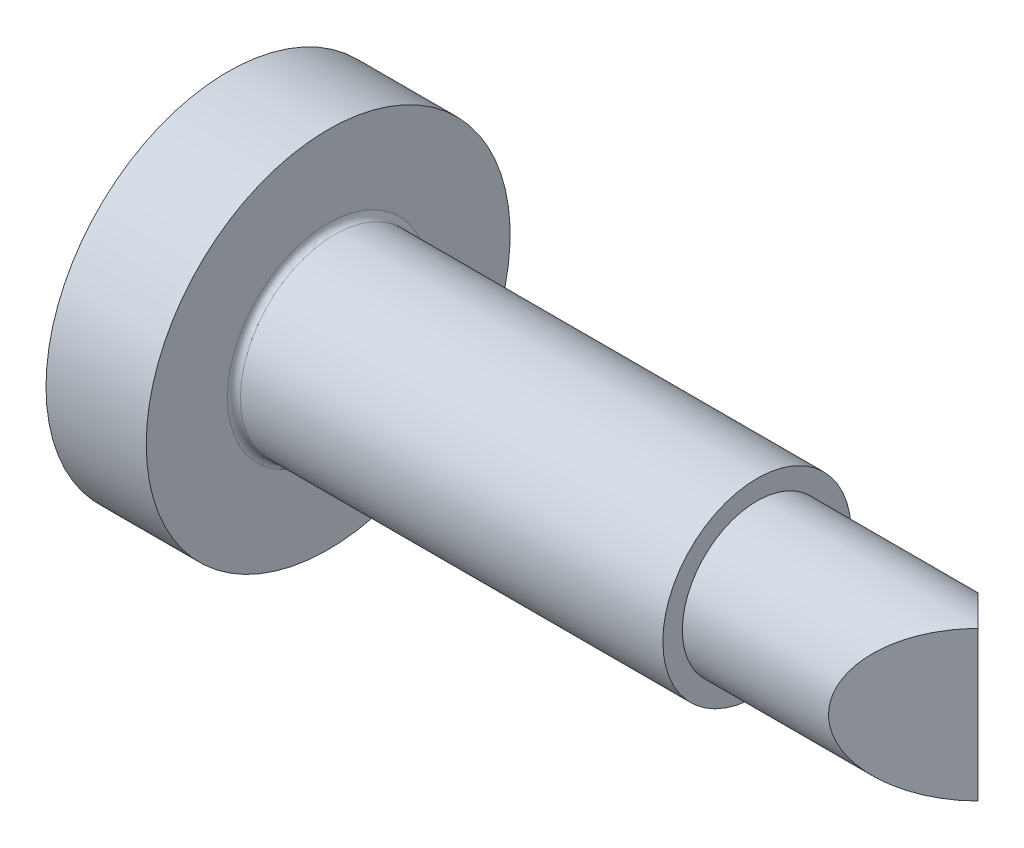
ISO-10303-21;
HEADER;
FILE_DESCRIPTION(('STEP AP214'),'2;1');
FILE_NAME('part.step','',(''),(''),'','','');
FILE_SCHEMA(('AUTOMOTIVE_DESIGN { 1 0 10303 214 1 1 1 1 }'));
ENDSEC;
DATA;
#1=APPLICATION_CONTEXT('core data for automotive mechanical design processes');
#2=APPLICATION_PROTOCOL_DEFINITION('international standard','automotive_design',2000,#1);
#3=PRODUCT_CONTEXT('',#1,'mechanical');
#4=PRODUCT('Part','Part','',(#3));
#5=PRODUCT_RELATED_PRODUCT_CATEGORY('part','',(#4));
#6=PRODUCT_DEFINITION_FORMATION('','',#4);
#7=PRODUCT_DEFINITION_CONTEXT('part definition',#1,'design');
#8=PRODUCT_DEFINITION('design','',#6,#7);
#9=PRODUCT_DEFINITION_SHAPE('','',#8);
#10=(LENGTH_UNIT() NAMED_UNIT(*) SI_UNIT(.MILLI.,.METRE.));
#11=(NAMED_UNIT(*) PLANE_ANGLE_UNIT() SI_UNIT($,.RADIAN.));
#12=(NAMED_UNIT(*) SI_UNIT($,.STERADIAN.) SOLID_ANGLE_UNIT());
#13=UNCERTAINTY_MEASURE_WITH_UNIT(LENGTH_MEASURE(1.E-05),#10,'distance_accuracy_value','');
#14=(GEOMETRIC_REPRESENTATION_CONTEXT(3) GLOBAL_UNCERTAINTY_ASSIGNED_CONTEXT((#13)) GLOBAL_UNIT_ASSIGNED_CONTEXT((#10,
#11,#12)) REPRESENTATION_CONTEXT('',''));
#15=CARTESIAN_POINT('',(0.,0.,0.));
#16=DIRECTION('',(0.,0.,1.));
#17=DIRECTION('',(1.,0.,0.));
#18=AXIS2_PLACEMENT_3D('',#15,#16,#17);
#19=CARTESIAN_POINT('',(5.,0.,0.));
#20=DIRECTION('',(-1.,0.,0.));
#21=DIRECTION('',(0.,1.,0.));
#22=AXIS2_PLACEMENT_3D('',#19,#20,#21);
#23=SPHERICAL_SURFACE('',#22,5.);
#24=CARTESIAN_POINT('',(0.857536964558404,0.,0.));
#25=DIRECTION('',(-1.,0.,0.));
#26=DIRECTION('',(0.,0.,1.));
#27=AXIS2_PLACEMENT_3D('',#24,#25,#26);
#28=CIRCLE('',#27,2.8);
#29=CARTESIAN_POINT('',(0.857536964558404,0.,2.8));
#30=VERTEX_POINT('',#29);
#31=EDGE_CURVE('E216',#30,#30,#28,.T.);
#32=ORIENTED_EDGE('',*,*,#31,.T.);
#33=EDGE_LOOP('',(#32));
#34=FACE_BOUND('',#33,.T.);
#35=CARTESIAN_POINT('',(5.,0.336215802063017,-0.19411428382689));
#36=DIRECTION('',(0.,-0.866025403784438,0.500000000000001));
#37=DIRECTION('',(0.,-0.500000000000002,-0.866025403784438));
#38=AXIS2_PLACEMENT_3D('',#35,#36,#37);
#39=CIRCLE('',#38,4.98490507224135);
#40=CARTESIAN_POINT('',(0.230303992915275,1.06066017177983,1.06066017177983));
#41=VERTEX_POINT('',#40);
#42=CARTESIAN_POINT('',(0.0478543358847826,0.621492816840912,0.3));
#43=VERTEX_POINT('',#42);
#44=EDGE_CURVE('E114',#41,#43,#39,.T.);
#45=ORIENTED_EDGE('',*,*,#44,.F.);
#46=CARTESIAN_POINT('',(5.,-0.194114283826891,0.336215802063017));
#47=DIRECTION('',(0.,0.500000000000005,-0.866025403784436));
#48=DIRECTION('',(0.,0.866025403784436,0.500000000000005));
#49=AXIS2_PLACEMENT_3D('',#46,#47,#48);
#50=CIRCLE('',#49,4.98490507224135);
#51=CARTESIAN_POINT('',(0.0478543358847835,0.299999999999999,0.621492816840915));
#52=VERTEX_POINT('',#51);
#53=EDGE_CURVE('E249',#52,#41,#50,.T.);
#54=ORIENTED_EDGE('',*,*,#53,.F.);
#55=CARTESIAN_POINT('',(5.,0.299999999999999,0.));
#56=DIRECTION('',(0.,-1.,0.));
#57=DIRECTION('',(0.,0.,-1.));
#58=AXIS2_PLACEMENT_3D('',#55,#56,#57);
#59=CIRCLE('',#58,4.99099188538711);
#60=CARTESIAN_POINT('',(0.20999223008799,0.3,1.40207901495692));
#61=VERTEX_POINT('',#60);
#62=EDGE_CURVE('E181',#61,#52,#59,.T.);
#63=ORIENTED_EDGE('',*,*,#62,.F.);
#64=CARTESIAN_POINT('',(4.68150235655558,0.,-0.683020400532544));
#65=DIRECTION('',(-0.4226182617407,0.,-0.90630778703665));
#66=DIRECTION('',(-0.90630778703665,0.,0.4226182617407));
#67=AXIS2_PLACEMENT_3D('',#64,#65,#66);
#68=CIRCLE('',#67,4.94287794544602);
#69=CARTESIAN_POINT('',(0.20999223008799,-0.3,1.40207901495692));
#70=VERTEX_POINT('',#69);
#71=EDGE_CURVE('E179',#70,#61,#68,.T.);
#72=ORIENTED_EDGE('',*,*,#71,.F.);
#73=CARTESIAN_POINT('',(5.,-0.299999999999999,0.));
#74=DIRECTION('',(0.,1.,0.));
#75=DIRECTION('',(0.,0.,1.));
#76=AXIS2_PLACEMENT_3D('',#73,#74,#75);
#77=CIRCLE('',#76,4.99099188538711);
#78=CARTESIAN_POINT('',(0.0478543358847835,-0.299999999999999,0.621492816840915));
#79=VERTEX_POINT('',#78);
#80=EDGE_CURVE('E182',#79,#70,#77,.T.);
#81=ORIENTED_EDGE('',*,*,#80,.F.);
#82=CARTESIAN_POINT('',(5.,0.194114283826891,0.336215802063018));
#83=DIRECTION('',(0.,-0.500000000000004,-0.866025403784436));
#84=DIRECTION('',(0.,0.866025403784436,-0.500000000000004));
#85=AXIS2_PLACEMENT_3D('',#82,#83,#84);
#86=CIRCLE('',#85,4.98490507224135);
#87=CARTESIAN_POINT('',(0.230303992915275,-1.06066017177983,1.06066017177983));
#88=VERTEX_POINT('',#87);
#89=EDGE_CURVE('E256',#88,#79,#86,.T.);
#90=ORIENTED_EDGE('',*,*,#89,.F.);
#91=CARTESIAN_POINT('',(5.,-0.336215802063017,-0.19411428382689));
#92=DIRECTION('',(0.,0.866025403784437,0.500000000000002));
#93=DIRECTION('',(0.,-0.500000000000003,0.866025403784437));
#94=AXIS2_PLACEMENT_3D('',#91,#92,#93);
#95=CIRCLE('',#94,4.98490507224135);
#96=CARTESIAN_POINT('',(0.0478543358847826,-0.621492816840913,0.3));
#97=VERTEX_POINT('',#96);
#98=EDGE_CURVE('E264',#97,#88,#95,.T.);
#99=ORIENTED_EDGE('',*,*,#98,.F.);
#100=CARTESIAN_POINT('',(5.,0.,0.3));
#101=DIRECTION('',(0.,0.,-1.));
#102=DIRECTION('',(-1.,0.,0.));
#103=AXIS2_PLACEMENT_3D('',#100,#101,#102);
#104=CIRCLE('',#103,4.99099188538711);
#105=CARTESIAN_POINT('',(0.20999223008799,-1.40207901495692,0.3));
#106=VERTEX_POINT('',#105);
#107=EDGE_CURVE('E153',#106,#97,#104,.T.);
#108=ORIENTED_EDGE('',*,*,#107,.F.);
#109=CARTESIAN_POINT('',(4.68150235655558,0.683020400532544,0.));
#110=DIRECTION('',(-0.4226182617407,0.90630778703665,0.));
#111=DIRECTION('',(-0.90630778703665,-0.4226182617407,0.));
#112=AXIS2_PLACEMENT_3D('',#109,#110,#111);
#113=CIRCLE('',#112,4.94287794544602);
#114=CARTESIAN_POINT('',(0.20999223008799,-1.40207901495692,-0.300000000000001));
#115=VERTEX_POINT('',#114);
#116=EDGE_CURVE('E151',#115,#106,#113,.T.);
#117=ORIENTED_EDGE('',*,*,#116,.F.);
#118=CARTESIAN_POINT('',(5.,0.,-0.300000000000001));
#119=DIRECTION('',(0.,0.,1.));
#120=DIRECTION('',(0.,-1.,0.));
#121=AXIS2_PLACEMENT_3D('',#118,#119,#120);
#122=CIRCLE('',#121,4.99099188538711);
#123=CARTESIAN_POINT('',(0.0478543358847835,-0.621492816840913,-0.300000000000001));
#124=VERTEX_POINT('',#123);
#125=EDGE_CURVE('E11',#124,#115,#122,.T.);
#126=ORIENTED_EDGE('',*,*,#125,.F.);
#127=CARTESIAN_POINT('',(5.,-0.336215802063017,0.19411428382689));
#128=DIRECTION('',(0.,0.866025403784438,-0.500000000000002));
#129=DIRECTION('',(0.,0.500000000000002,0.866025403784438));
#130=AXIS2_PLACEMENT_3D('',#127,#128,#129);
#131=CIRCLE('',#130,4.98490507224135);
#132=CARTESIAN_POINT('',(0.230303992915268,-1.06066017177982,-1.06066017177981));
#133=VERTEX_POINT('',#132);
#134=EDGE_CURVE('E270',#133,#124,#131,.T.);
#135=ORIENTED_EDGE('',*,*,#134,.F.);
#136=CARTESIAN_POINT('',(5.,0.194114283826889,-0.336215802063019));
#137=DIRECTION('',(0.,-0.499999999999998,0.86602540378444));
#138=DIRECTION('',(0.,-0.86602540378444,-0.499999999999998));
#139=AXIS2_PLACEMENT_3D('',#136,#137,#138);
#140=CIRCLE('',#139,4.98490507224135);
#141=CARTESIAN_POINT('',(0.0478543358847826,-0.3,-0.62149281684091));
#142=VERTEX_POINT('',#141);
#143=EDGE_CURVE('E146',#142,#133,#140,.T.);
#144=ORIENTED_EDGE('',*,*,#143,.F.);
#145=CARTESIAN_POINT('',(5.,-0.299999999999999,0.));
#146=DIRECTION('',(0.,1.,0.));
#147=DIRECTION('',(0.,0.,1.));
#148=AXIS2_PLACEMENT_3D('',#145,#146,#147);
#149=CIRCLE('',#148,4.99099188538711);
#150=CARTESIAN_POINT('',(0.20999223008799,-0.3,-1.40207901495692));
#151=VERTEX_POINT('',#150);
#152=EDGE_CURVE('E46',#151,#142,#149,.T.);
#153=ORIENTED_EDGE('',*,*,#152,.F.);
#154=CARTESIAN_POINT('',(4.68150235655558,0.,0.683020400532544));
#155=DIRECTION('',(-0.4226182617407,0.,0.90630778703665));
#156=DIRECTION('',(0.90630778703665,0.,0.4226182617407));
#157=AXIS2_PLACEMENT_3D('',#154,#155,#156);
#158=CIRCLE('',#157,4.94287794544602);
#159=CARTESIAN_POINT('',(0.20999223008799,0.3,-1.40207901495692));
#160=VERTEX_POINT('',#159);
#161=EDGE_CURVE('E129',#160,#151,#158,.T.);
#162=ORIENTED_EDGE('',*,*,#161,.F.);
#163=CARTESIAN_POINT('',(5.,0.299999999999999,0.));
#164=DIRECTION('',(0.,-1.,0.));
#165=DIRECTION('',(0.,0.,-1.));
#166=AXIS2_PLACEMENT_3D('',#163,#164,#165);
#167=CIRCLE('',#166,4.99099188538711);
#168=CARTESIAN_POINT('',(0.0478543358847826,0.3,-0.621492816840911));
#169=VERTEX_POINT('',#168);
#170=EDGE_CURVE('E137',#169,#160,#167,.T.);
#171=ORIENTED_EDGE('',*,*,#170,.F.);
#172=CARTESIAN_POINT('',(5.,-0.194114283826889,-0.33621580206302));
#173=DIRECTION('',(0.,0.499999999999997,0.86602540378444));
#174=DIRECTION('',(0.,-0.86602540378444,0.499999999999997));
#175=AXIS2_PLACEMENT_3D('',#172,#173,#174);
#176=CIRCLE('',#175,4.98490507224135);
#177=CARTESIAN_POINT('',(0.230303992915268,1.06066017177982,-1.06066017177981));
#178=VERTEX_POINT('',#177);
#179=EDGE_CURVE('E278',#178,#169,#176,.T.);
#180=ORIENTED_EDGE('',*,*,#179,.F.);
#181=CARTESIAN_POINT('',(5.,0.336215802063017,0.19411428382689));
#182=DIRECTION('',(0.,-0.866025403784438,-0.500000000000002));
#183=DIRECTION('',(0.,0.500000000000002,-0.866025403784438));
#184=AXIS2_PLACEMENT_3D('',#181,#182,#183);
#185=CIRCLE('',#184,4.98490507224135);
#186=CARTESIAN_POINT('',(0.0478543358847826,0.621492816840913,-0.300000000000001));
#187=VERTEX_POINT('',#186);
#188=EDGE_CURVE('E284',#187,#178,#185,.T.);
#189=ORIENTED_EDGE('',*,*,#188,.F.);
#190=CARTESIAN_POINT('',(5.,0.,-0.300000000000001));
#191=DIRECTION('',(0.,0.,1.));
#192=DIRECTION('',(0.,-1.,0.));
#193=AXIS2_PLACEMENT_3D('',#190,#191,#192);
#194=CIRCLE('',#193,4.99099188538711);
#195=CARTESIAN_POINT('',(0.20999223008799,1.40207901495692,-0.3));
#196=VERTEX_POINT('',#195);
#197=EDGE_CURVE('E166',#196,#187,#194,.T.);
#198=ORIENTED_EDGE('',*,*,#197,.F.);
#199=CARTESIAN_POINT('',(4.68150235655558,-0.683020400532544,0.));
#200=DIRECTION('',(-0.4226182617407,-0.90630778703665,0.));
#201=DIRECTION('',(0.90630778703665,-0.4226182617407,0.));
#202=AXIS2_PLACEMENT_3D('',#199,#200,#201);
#203=CIRCLE('',#202,4.94287794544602);
#204=CARTESIAN_POINT('',(0.20999223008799,1.40207901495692,0.3));
#205=VERTEX_POINT('',#204);
#206=EDGE_CURVE('E164',#205,#196,#203,.T.);
#207=ORIENTED_EDGE('',*,*,#206,.F.);
#208=CARTESIAN_POINT('',(5.,0.,0.3));
#209=DIRECTION('',(0.,0.,-1.));
#210=DIRECTION('',(-1.,0.,0.));
#211=AXIS2_PLACEMENT_3D('',#208,#209,#210);
#212=CIRCLE('',#211,4.99099188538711);
#213=EDGE_CURVE('E167',#43,#205,#212,.T.);
#214=ORIENTED_EDGE('',*,*,#213,.F.);
#215=EDGE_LOOP('',(#45,#54,#63,#72,#81,#90,#99,#108,#117,#126,#135,#144,#153,#162,#171,#180,
#189,#198,#207,#214));
#216=FACE_BOUND('',#215,.T.);
#217=ADVANCED_FACE('F36',(#34,#216),#23,.T.);
#218=CARTESIAN_POINT('',(0.8,-1.5,-0.300000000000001));
#219=DIRECTION('',(0.,0.,1.));
#220=DIRECTION('',(0.,-1.,0.));
#221=AXIS2_PLACEMENT_3D('',#218,#219,#220);
#222=PLANE('',#221);
#223=DIRECTION('',(0.,1.,0.));
#224=VECTOR('',#223,1.);
#225=CARTESIAN_POINT('',(0.8,-1.5,-0.300000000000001));
#226=LINE('',#225,#224);
#227=CARTESIAN_POINT('',(0.8,-1.126953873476,-0.300000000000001));
#228=VERTEX_POINT('',#227);
#229=CARTESIAN_POINT('',(0.8,-0.621492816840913,-0.300000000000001));
#230=VERTEX_POINT('',#229);
#231=EDGE_CURVE('E195',#228,#230,#226,.T.);
#232=ORIENTED_EDGE('',*,*,#231,.T.);
#233=DIRECTION('',(-1.,0.,0.));
#234=VECTOR('',#233,1.);
#235=CARTESIAN_POINT('',(0.8,-0.621492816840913,-0.300000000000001));
#236=LINE('',#235,#234);
#237=EDGE_CURVE('E273',#230,#124,#236,.T.);
#238=ORIENTED_EDGE('',*,*,#237,.T.);
#239=ORIENTED_EDGE('',*,*,#125,.T.);
#240=DIRECTION('',(-0.90630778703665,-0.4226182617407,0.));
#241=VECTOR('',#240,1.);
#242=CARTESIAN_POINT('',(0.657115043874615,-1.19358222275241,-0.300000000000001));
#243=LINE('',#242,#241);
#244=EDGE_CURVE('E155',#228,#115,#243,.T.);
#245=ORIENTED_EDGE('',*,*,#244,.F.);
#246=EDGE_LOOP('',(#232,#238,#239,#245));
#247=FACE_BOUND('',#246,.T.);
#248=ADVANCED_FACE('F346',(#247),#222,.T.);
#249=CARTESIAN_POINT('',(0.8,-0.3,-1.5));
#250=DIRECTION('',(0.,1.,0.));
#251=DIRECTION('',(0.,0.,1.));
#252=AXIS2_PLACEMENT_3D('',#249,#250,#251);
#253=PLANE('',#252);
#254=ORIENTED_EDGE('',*,*,#152,.T.);
#255=DIRECTION('',(1.,0.,0.));
#256=VECTOR('',#255,1.);
#257=CARTESIAN_POINT('',(0.8,-0.3,-0.62149281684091));
#258=LINE('',#257,#256);
#259=CARTESIAN_POINT('',(0.8,-0.3,-0.62149281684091));
#260=VERTEX_POINT('',#259);
#261=EDGE_CURVE('E276',#142,#260,#258,.T.);
#262=ORIENTED_EDGE('',*,*,#261,.T.);
#263=DIRECTION('',(0.,0.,-1.));
#264=VECTOR('',#263,1.);
#265=CARTESIAN_POINT('',(0.8,-0.3,-1.5));
#266=LINE('',#265,#264);
#267=CARTESIAN_POINT('',(0.8,-0.3,-1.126953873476));
#268=VERTEX_POINT('',#267);
#269=EDGE_CURVE('E105',#260,#268,#266,.T.);
#270=ORIENTED_EDGE('',*,*,#269,.T.);
#271=DIRECTION('',(-0.90630778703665,0.,-0.4226182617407));
#272=VECTOR('',#271,1.);
#273=CARTESIAN_POINT('',(0.,-0.3,-1.5));
#274=LINE('',#273,#272);
#275=EDGE_CURVE('E40',#268,#151,#274,.T.);
#276=ORIENTED_EDGE('',*,*,#275,.T.);
#277=EDGE_LOOP('',(#254,#262,#270,#276));
#278=FACE_BOUND('',#277,.T.);
#279=ADVANCED_FACE('F140',(#278),#253,.T.);
#280=CARTESIAN_POINT('',(0.8,0.3,-1.5));
#281=DIRECTION('',(0.,-1.,0.));
#282=DIRECTION('',(0.,0.,-1.));
#283=AXIS2_PLACEMENT_3D('',#280,#281,#282);
#284=PLANE('',#283);
#285=DIRECTION('',(0.,0.,1.));
#286=VECTOR('',#285,1.);
#287=CARTESIAN_POINT('',(0.8,0.3,-1.5));
#288=LINE('',#287,#286);
#289=CARTESIAN_POINT('',(0.8,0.3,-1.126953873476));
#290=VERTEX_POINT('',#289);
#291=CARTESIAN_POINT('',(0.8,0.3,-0.621492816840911));
#292=VERTEX_POINT('',#291);
#293=EDGE_CURVE('E192',#290,#292,#288,.T.);
#294=ORIENTED_EDGE('',*,*,#293,.T.);
#295=DIRECTION('',(-1.,0.,0.));
#296=VECTOR('',#295,1.);
#297=CARTESIAN_POINT('',(0.8,0.3,-0.621492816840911));
#298=LINE('',#297,#296);
#299=EDGE_CURVE('E281',#292,#169,#298,.T.);
#300=ORIENTED_EDGE('',*,*,#299,.T.);
#301=ORIENTED_EDGE('',*,*,#170,.T.);
#302=DIRECTION('',(-0.90630778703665,0.,-0.4226182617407));
#303=VECTOR('',#302,1.);
#304=CARTESIAN_POINT('',(0.657115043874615,0.3,-1.19358222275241));
#305=LINE('',#304,#303);
#306=EDGE_CURVE('E133',#290,#160,#305,.T.);
#307=ORIENTED_EDGE('',*,*,#306,.F.);
#308=EDGE_LOOP('',(#294,#300,#301,#307));
#309=FACE_BOUND('',#308,.T.);
#310=ADVANCED_FACE('F454',(#309),#284,.T.);
#311=CARTESIAN_POINT('',(0.8,0.299999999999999,-0.300000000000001));
#312=DIRECTION('',(0.,0.,1.));
#313=DIRECTION('',(0.,-1.,0.));
#314=AXIS2_PLACEMENT_3D('',#311,#312,#313);
#315=PLANE('',#314);
#316=ORIENTED_EDGE('',*,*,#197,.T.);
#317=DIRECTION('',(1.,0.,0.));
#318=VECTOR('',#317,1.);
#319=CARTESIAN_POINT('',(0.8,0.621492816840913,-0.300000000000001));
#320=LINE('',#319,#318);
#321=CARTESIAN_POINT('',(0.8,0.621492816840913,-0.3));
#322=VERTEX_POINT('',#321);
#323=EDGE_CURVE('E287',#187,#322,#320,.T.);
#324=ORIENTED_EDGE('',*,*,#323,.T.);
#325=DIRECTION('',(0.,1.,0.));
#326=VECTOR('',#325,1.);
#327=CARTESIAN_POINT('',(0.8,0.299999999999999,-0.300000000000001));
#328=LINE('',#327,#326);
#329=CARTESIAN_POINT('',(0.8,1.126953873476,-0.3));
#330=VERTEX_POINT('',#329);
#331=EDGE_CURVE('E176',#322,#330,#328,.T.);
#332=ORIENTED_EDGE('',*,*,#331,.T.);
#333=DIRECTION('',(-0.90630778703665,0.4226182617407,0.));
#334=VECTOR('',#333,1.);
#335=CARTESIAN_POINT('',(0.,1.5,-0.3));
#336=LINE('',#335,#334);
#337=EDGE_CURVE('E171',#330,#196,#336,.T.);
#338=ORIENTED_EDGE('',*,*,#337,.T.);
#339=EDGE_LOOP('',(#316,#324,#332,#338));
#340=FACE_BOUND('',#339,.T.);
#341=ADVANCED_FACE('F467',(#340),#315,.T.);
#342=CARTESIAN_POINT('',(0.8,0.299999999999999,0.3));
#343=DIRECTION('',(0.,0.,-1.));
#344=DIRECTION('',(-1.,0.,0.));
#345=AXIS2_PLACEMENT_3D('',#342,#343,#344);
#346=PLANE('',#345);
#347=DIRECTION('',(0.,-1.,0.));
#348=VECTOR('',#347,1.);
#349=CARTESIAN_POINT('',(0.8,0.299999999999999,0.3));
#350=LINE('',#349,#348);
#351=CARTESIAN_POINT('',(0.8,1.126953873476,0.3));
#352=VERTEX_POINT('',#351);
#353=CARTESIAN_POINT('',(0.8,0.621492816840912,0.3));
#354=VERTEX_POINT('',#353);
#355=EDGE_CURVE('E175',#352,#354,#350,.T.);
#356=ORIENTED_EDGE('',*,*,#355,.T.);
#357=DIRECTION('',(-1.,0.,0.));
#358=VECTOR('',#357,1.);
#359=CARTESIAN_POINT('',(0.8,0.621492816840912,0.3));
#360=LINE('',#359,#358);
#361=EDGE_CURVE('E253',#354,#43,#360,.T.);
#362=ORIENTED_EDGE('',*,*,#361,.T.);
#363=ORIENTED_EDGE('',*,*,#213,.T.);
#364=DIRECTION('',(-0.90630778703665,0.4226182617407,0.));
#365=VECTOR('',#364,1.);
#366=CARTESIAN_POINT('',(1.116741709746,0.979254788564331,0.3));
#367=LINE('',#366,#365);
#368=EDGE_CURVE('E168',#352,#205,#367,.T.);
#369=ORIENTED_EDGE('',*,*,#368,.F.);
#370=EDGE_LOOP('',(#356,#362,#363,#369));
#371=FACE_BOUND('',#370,.T.);
#372=ADVANCED_FACE('F471',(#371),#346,.T.);
#373=CARTESIAN_POINT('',(0.8,0.299999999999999,0.3));
#374=DIRECTION('',(0.,-1.,0.));
#375=DIRECTION('',(0.,0.,-1.));
#376=AXIS2_PLACEMENT_3D('',#373,#374,#375);
#377=PLANE('',#376);
#378=ORIENTED_EDGE('',*,*,#62,.T.);
#379=DIRECTION('',(1.,0.,0.));
#380=VECTOR('',#379,1.);
#381=CARTESIAN_POINT('',(0.8,0.299999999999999,0.621492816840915));
#382=LINE('',#381,#380);
#383=CARTESIAN_POINT('',(0.8,0.299999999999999,0.621492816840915));
#384=VERTEX_POINT('',#383);
#385=EDGE_CURVE('E242',#52,#384,#382,.T.);
#386=ORIENTED_EDGE('',*,*,#385,.T.);
#387=DIRECTION('',(0.,0.,1.));
#388=VECTOR('',#387,1.);
#389=CARTESIAN_POINT('',(0.8,0.299999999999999,0.3));
#390=LINE('',#389,#388);
#391=CARTESIAN_POINT('',(0.8,0.3,1.126953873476));
#392=VERTEX_POINT('',#391);
#393=EDGE_CURVE('E188',#384,#392,#390,.T.);
#394=ORIENTED_EDGE('',*,*,#393,.T.);
#395=DIRECTION('',(-0.90630778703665,0.,0.4226182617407));
#396=VECTOR('',#395,1.);
#397=CARTESIAN_POINT('',(0.,0.3,1.5));
#398=LINE('',#397,#396);
#399=EDGE_CURVE('E172',#392,#61,#398,.T.);
#400=ORIENTED_EDGE('',*,*,#399,.T.);
#401=EDGE_LOOP('',(#378,#386,#394,#400));
#402=FACE_BOUND('',#401,.T.);
#403=ADVANCED_FACE('F240',(#402),#377,.T.);
#404=CARTESIAN_POINT('',(0.8,-0.299999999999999,0.3));
#405=DIRECTION('',(0.,1.,0.));
#406=DIRECTION('',(0.,0.,1.));
#407=AXIS2_PLACEMENT_3D('',#404,#405,#406);
#408=PLANE('',#407);
#409=DIRECTION('',(0.,0.,-1.));
#410=VECTOR('',#409,1.);
#411=CARTESIAN_POINT('',(0.8,-0.299999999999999,0.3));
#412=LINE('',#411,#410);
#413=CARTESIAN_POINT('',(0.8,-0.3,1.126953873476));
#414=VERTEX_POINT('',#413);
#415=CARTESIAN_POINT('',(0.8,-0.3,0.621492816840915));
#416=VERTEX_POINT('',#415);
#417=EDGE_CURVE('E187',#414,#416,#412,.T.);
#418=ORIENTED_EDGE('',*,*,#417,.T.);
#419=DIRECTION('',(-1.,0.,0.));
#420=VECTOR('',#419,1.);
#421=CARTESIAN_POINT('',(0.8,-0.299999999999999,0.621492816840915));
#422=LINE('',#421,#420);
#423=EDGE_CURVE('E261',#416,#79,#422,.T.);
#424=ORIENTED_EDGE('',*,*,#423,.T.);
#425=ORIENTED_EDGE('',*,*,#80,.T.);
#426=DIRECTION('',(-0.90630778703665,0.,0.4226182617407));
#427=VECTOR('',#426,1.);
#428=CARTESIAN_POINT('',(1.116741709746,-0.3,0.979254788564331));
#429=LINE('',#428,#427);
#430=EDGE_CURVE('E163',#414,#70,#429,.T.);
#431=ORIENTED_EDGE('',*,*,#430,.F.);
#432=EDGE_LOOP('',(#418,#424,#425,#431));
#433=FACE_BOUND('',#432,.T.);
#434=ADVANCED_FACE('F388',(#433),#408,.T.);
#435=CARTESIAN_POINT('',(0.8,-1.5,0.3));
#436=DIRECTION('',(0.,0.,-1.));
#437=DIRECTION('',(-1.,0.,0.));
#438=AXIS2_PLACEMENT_3D('',#435,#436,#437);
#439=PLANE('',#438);
#440=ORIENTED_EDGE('',*,*,#107,.T.);
#441=DIRECTION('',(1.,0.,0.));
#442=VECTOR('',#441,1.);
#443=CARTESIAN_POINT('',(0.8,-0.621492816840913,0.3));
#444=LINE('',#443,#442);
#445=CARTESIAN_POINT('',(0.8,-0.621492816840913,0.300000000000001));
#446=VERTEX_POINT('',#445);
#447=EDGE_CURVE('E267',#97,#446,#444,.T.);
#448=ORIENTED_EDGE('',*,*,#447,.T.);
#449=DIRECTION('',(0.,-1.,0.));
#450=VECTOR('',#449,1.);
#451=CARTESIAN_POINT('',(0.8,-1.5,0.3));
#452=LINE('',#451,#450);
#453=CARTESIAN_POINT('',(0.8,-1.126953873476,0.3));
#454=VERTEX_POINT('',#453);
#455=EDGE_CURVE('E160',#446,#454,#452,.T.);
#456=ORIENTED_EDGE('',*,*,#455,.T.);
#457=DIRECTION('',(-0.90630778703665,-0.4226182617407,0.));
#458=VECTOR('',#457,1.);
#459=CARTESIAN_POINT('',(0.,-1.5,0.3));
#460=LINE('',#459,#458);
#461=EDGE_CURVE('E157',#454,#106,#460,.T.);
#462=ORIENTED_EDGE('',*,*,#461,.T.);
#463=EDGE_LOOP('',(#440,#448,#456,#462));
#464=FACE_BOUND('',#463,.T.);
#465=ADVANCED_FACE('F364',(#464),#439,.T.);
#466=CARTESIAN_POINT('',(2.4,1.45,0.));
#467=DIRECTION('',(-1.,0.,0.));
#468=DIRECTION('',(0.,0.,1.));
#469=AXIS2_PLACEMENT_3D('',#466,#467,#468);
#470=PLANE('',#469);
#471=CARTESIAN_POINT('',(2.4,0.,0.));
#472=DIRECTION('',(-1.,0.,0.));
#473=DIRECTION('',(0.,0.,1.));
#474=AXIS2_PLACEMENT_3D('',#471,#472,#473);
#475=CIRCLE('',#474,1.55);
#476=CARTESIAN_POINT('',(2.4,0.,1.55));
#477=VERTEX_POINT('',#476);
#478=EDGE_CURVE('E223',#477,#477,#475,.T.);
#479=ORIENTED_EDGE('',*,*,#478,.T.);
#480=EDGE_LOOP('',(#479));
#481=FACE_BOUND('',#480,.T.);
#482=CARTESIAN_POINT('',(2.4,0.,0.));
#483=DIRECTION('',(-1.,0.,0.));
#484=DIRECTION('',(0.,0.,1.));
#485=AXIS2_PLACEMENT_3D('',#482,#483,#484);
#486=CIRCLE('',#485,2.8);
#487=CARTESIAN_POINT('',(2.4,0.,2.8));
#488=VERTEX_POINT('',#487);
#489=EDGE_CURVE('E219',#488,#488,#486,.T.);
#490=ORIENTED_EDGE('',*,*,#489,.F.);
#491=EDGE_LOOP('',(#490));
#492=FACE_BOUND('',#491,.T.);
#493=ADVANCED_FACE('F360',(#481,#492),#470,.F.);
#494=CARTESIAN_POINT('',(-43.1593495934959,0.,0.));
#495=DIRECTION('',(-1.,0.,0.));
#496=DIRECTION('',(0.,0.,1.));
#497=AXIS2_PLACEMENT_3D('',#494,#495,#496);
#498=CYLINDRICAL_SURFACE('',#497,2.8);
#499=ORIENTED_EDGE('',*,*,#31,.F.);
#500=EDGE_LOOP('',(#499));
#501=FACE_BOUND('',#500,.T.);
#502=ORIENTED_EDGE('',*,*,#489,.T.);
#503=EDGE_LOOP('',(#502));
#504=FACE_BOUND('',#503,.T.);
#505=ADVANCED_FACE('F357',(#501,#504),#498,.T.);
#506=CARTESIAN_POINT('',(-43.1593495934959,0.,0.));
#507=DIRECTION('',(-1.,0.,0.));
#508=DIRECTION('',(0.,0.,1.));
#509=AXIS2_PLACEMENT_3D('',#506,#507,#508);
#510=CYLINDRICAL_SURFACE('',#509,1.15);
#511=CARTESIAN_POINT('',(9.,0.,0.));
#512=DIRECTION('',(-1.,0.,0.));
#513=DIRECTION('',(0.,0.,1.));
#514=AXIS2_PLACEMENT_3D('',#511,#512,#513);
#515=CIRCLE('',#514,1.15);
#516=CARTESIAN_POINT('',(9.,0.,1.15));
#517=VERTEX_POINT('',#516);
#518=EDGE_CURVE('E213',#517,#517,#515,.T.);
#519=ORIENTED_EDGE('',*,*,#518,.F.);
#520=EDGE_LOOP('',(#519));
#521=FACE_BOUND('',#520,.T.);
#522=CARTESIAN_POINT('',(12.4,0.,0.));
#523=DIRECTION('',(-0.707106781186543,0.,-0.707106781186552));
#524=DIRECTION('',(-0.707106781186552,0.,0.707106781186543));
#525=AXIS2_PLACEMENT_3D('',#522,#523,#524);
#526=ELLIPSE('',#525,1.62634559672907,1.15);
#527=CARTESIAN_POINT('',(12.4,-1.15,0.));
#528=VERTEX_POINT('',#527);
#529=CARTESIAN_POINT('',(12.4,1.15,0.));
#530=VERTEX_POINT('',#529);
#531=EDGE_CURVE('E154',#528,#530,#526,.T.);
#532=ORIENTED_EDGE('',*,*,#531,.T.);
#533=CARTESIAN_POINT('',(12.4,0.,0.));
#534=DIRECTION('',(-0.707106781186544,0.,0.707106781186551));
#535=DIRECTION('',(-0.707106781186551,0.,-0.707106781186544));
#536=AXIS2_PLACEMENT_3D('',#533,#534,#535);
#537=ELLIPSE('',#536,1.62634559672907,1.15);
#538=EDGE_CURVE('E123',#530,#528,#537,.T.);
#539=ORIENTED_EDGE('',*,*,#538,.T.);
#540=EDGE_LOOP('',(#532,#539));
#541=FACE_BOUND('',#540,.T.);
#542=ADVANCED_FACE('F355',(#521,#541),#510,.T.);
#543=CARTESIAN_POINT('',(9.,1.45,0.));
#544=DIRECTION('',(-1.,0.,0.));
#545=DIRECTION('',(0.,0.,1.));
#546=AXIS2_PLACEMENT_3D('',#543,#544,#545);
#547=PLANE('',#546);
#548=CARTESIAN_POINT('',(9.,0.,0.));
#549=DIRECTION('',(-1.,0.,0.));
#550=DIRECTION('',(0.,0.,1.));
#551=AXIS2_PLACEMENT_3D('',#548,#549,#550);
#552=CIRCLE('',#551,1.45);
#553=CARTESIAN_POINT('',(9.,0.,1.45));
#554=VERTEX_POINT('',#553);
#555=EDGE_CURVE('E210',#554,#554,#552,.T.);
#556=ORIENTED_EDGE('',*,*,#555,.F.);
#557=EDGE_LOOP('',(#556));
#558=FACE_BOUND('',#557,.T.);
#559=ORIENTED_EDGE('',*,*,#518,.T.);
#560=EDGE_LOOP('',(#559));
#561=FACE_BOUND('',#560,.T.);
#562=ADVANCED_FACE('F495',(#558,#561),#547,.F.);
#563=CARTESIAN_POINT('',(-43.1593495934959,0.,0.));
#564=DIRECTION('',(-1.,0.,0.));
#565=DIRECTION('',(0.,0.,1.));
#566=AXIS2_PLACEMENT_3D('',#563,#564,#565);
#567=CYLINDRICAL_SURFACE('',#566,1.45);
#568=CARTESIAN_POINT('',(2.5,0.,0.));
#569=DIRECTION('',(-1.,0.,0.));
#570=DIRECTION('',(0.,0.,1.));
#571=AXIS2_PLACEMENT_3D('',#568,#569,#570);
#572=CIRCLE('',#571,1.45);
#573=CARTESIAN_POINT('',(2.5,0.,1.45));
#574=VERTEX_POINT('',#573);
#575=EDGE_CURVE('E226',#574,#574,#572,.F.);
#576=ORIENTED_EDGE('',*,*,#575,.T.);
#577=EDGE_LOOP('',(#576));
#578=FACE_BOUND('',#577,.T.);
#579=ORIENTED_EDGE('',*,*,#555,.T.);
#580=EDGE_LOOP('',(#579));
#581=FACE_BOUND('',#580,.T.);
#582=ADVANCED_FACE('F370',(#578,#581),#567,.T.);
#583=CARTESIAN_POINT('',(2.5,0.,0.));
#584=DIRECTION('',(-1.,0.,0.));
#585=DIRECTION('',(0.,0.,1.));
#586=AXIS2_PLACEMENT_3D('',#583,#584,#585);
#587=TOROIDAL_SURFACE('',#586,1.55,0.1);
#588=ORIENTED_EDGE('',*,*,#575,.F.);
#589=EDGE_LOOP('',(#588));
#590=FACE_BOUND('',#589,.T.);
#591=ORIENTED_EDGE('',*,*,#478,.F.);
#592=EDGE_LOOP('',(#591));
#593=FACE_BOUND('',#592,.T.);
#594=ADVANCED_FACE('F366',(#590,#593),#587,.F.);
#595=CARTESIAN_POINT('',(12.4,-2.8,0.));
#596=DIRECTION('',(-0.707106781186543,0.,-0.707106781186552));
#597=DIRECTION('',(-0.707106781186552,0.,0.707106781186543));
#598=AXIS2_PLACEMENT_3D('',#595,#596,#597);
#599=PLANE('',#598);
#600=ORIENTED_EDGE('',*,*,#531,.F.);
#601=DIRECTION('',(0.,1.,0.));
#602=VECTOR('',#601,1.);
#603=CARTESIAN_POINT('',(12.4,-2.8,0.));
#604=LINE('',#603,#602);
#605=EDGE_CURVE('E142',#528,#530,#604,.T.);
#606=ORIENTED_EDGE('',*,*,#605,.T.);
#607=EDGE_LOOP('',(#600,#606));
#608=FACE_BOUND('',#607,.T.);
#609=ADVANCED_FACE('F369',(#608),#599,.F.);
#610=CARTESIAN_POINT('',(12.4,-2.8,0.));
#611=DIRECTION('',(-0.707106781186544,0.,0.707106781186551));
#612=DIRECTION('',(0.707106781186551,0.,0.707106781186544));
#613=AXIS2_PLACEMENT_3D('',#610,#611,#612);
#614=PLANE('',#613);
#615=ORIENTED_EDGE('',*,*,#538,.F.);
#616=ORIENTED_EDGE('',*,*,#605,.F.);
#617=EDGE_LOOP('',(#615,#616));
#618=FACE_BOUND('',#617,.T.);
#619=ADVANCED_FACE('F378',(#618),#614,.F.);
#620=CARTESIAN_POINT('',(0.,0.,-1.5));
#621=DIRECTION('',(-0.4226182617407,0.,0.90630778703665));
#622=DIRECTION('',(0.90630778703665,0.,0.4226182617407));
#623=AXIS2_PLACEMENT_3D('',#620,#621,#622);
#624=PLANE('',#623);
#625=ORIENTED_EDGE('',*,*,#161,.T.);
#626=ORIENTED_EDGE('',*,*,#275,.F.);
#627=DIRECTION('',(0.,1.,0.));
#628=VECTOR('',#627,1.);
#629=CARTESIAN_POINT('',(0.8,0.,-1.126953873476));
#630=LINE('',#629,#628);
#631=EDGE_CURVE('E191',#268,#290,#630,.T.);
#632=ORIENTED_EDGE('',*,*,#631,.T.);
#633=ORIENTED_EDGE('',*,*,#306,.T.);
#634=EDGE_LOOP('',(#625,#626,#632,#633));
#635=FACE_BOUND('',#634,.T.);
#636=ADVANCED_FACE('F130',(#635),#624,.T.);
#637=CARTESIAN_POINT('',(0.,1.5,0.));
#638=DIRECTION('',(-0.4226182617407,-0.90630778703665,0.));
#639=DIRECTION('',(0.90630778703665,-0.4226182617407,0.));
#640=AXIS2_PLACEMENT_3D('',#637,#638,#639);
#641=PLANE('',#640);
#642=ORIENTED_EDGE('',*,*,#206,.T.);
#643=ORIENTED_EDGE('',*,*,#337,.F.);
#644=DIRECTION('',(0.,0.,1.));
#645=VECTOR('',#644,1.);
#646=CARTESIAN_POINT('',(0.8,1.126953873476,0.));
#647=LINE('',#646,#645);
#648=EDGE_CURVE('E173',#330,#352,#647,.T.);
#649=ORIENTED_EDGE('',*,*,#648,.T.);
#650=ORIENTED_EDGE('',*,*,#368,.T.);
#651=EDGE_LOOP('',(#642,#643,#649,#650));
#652=FACE_BOUND('',#651,.T.);
#653=ADVANCED_FACE('F38',(#652),#641,.T.);
#654=CARTESIAN_POINT('',(0.,0.,1.5));
#655=DIRECTION('',(-0.4226182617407,0.,-0.90630778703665));
#656=DIRECTION('',(-0.90630778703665,0.,0.4226182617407));
#657=AXIS2_PLACEMENT_3D('',#654,#655,#656);
#658=PLANE('',#657);
#659=ORIENTED_EDGE('',*,*,#71,.T.);
#660=ORIENTED_EDGE('',*,*,#399,.F.);
#661=DIRECTION('',(0.,-1.,0.));
#662=VECTOR('',#661,1.);
#663=CARTESIAN_POINT('',(0.8,0.,1.126953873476));
#664=LINE('',#663,#662);
#665=EDGE_CURVE('E185',#392,#414,#664,.T.);
#666=ORIENTED_EDGE('',*,*,#665,.T.);
#667=ORIENTED_EDGE('',*,*,#430,.T.);
#668=EDGE_LOOP('',(#659,#660,#666,#667));
#669=FACE_BOUND('',#668,.T.);
#670=ADVANCED_FACE('F375',(#669),#658,.T.);
#671=CARTESIAN_POINT('',(0.,-1.5,0.));
#672=DIRECTION('',(-0.4226182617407,0.90630778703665,0.));
#673=DIRECTION('',(-0.90630778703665,-0.4226182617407,0.));
#674=AXIS2_PLACEMENT_3D('',#671,#672,#673);
#675=PLANE('',#674);
#676=ORIENTED_EDGE('',*,*,#116,.T.);
#677=ORIENTED_EDGE('',*,*,#461,.F.);
#678=DIRECTION('',(0.,0.,-1.));
#679=VECTOR('',#678,1.);
#680=CARTESIAN_POINT('',(0.8,-1.126953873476,0.));
#681=LINE('',#680,#679);
#682=EDGE_CURVE('E158',#454,#228,#681,.T.);
#683=ORIENTED_EDGE('',*,*,#682,.T.);
#684=ORIENTED_EDGE('',*,*,#244,.T.);
#685=EDGE_LOOP('',(#676,#677,#683,#684));
#686=FACE_BOUND('',#685,.T.);
#687=ADVANCED_FACE('F372',(#686),#675,.T.);
#688=CARTESIAN_POINT('',(0.8,1.5,-0.3));
#689=DIRECTION('',(1.,0.,0.));
#690=DIRECTION('',(0.,0.,-1.));
#691=AXIS2_PLACEMENT_3D('',#688,#689,#690);
#692=PLANE('',#691);
#693=DIRECTION('',(0.,-0.500000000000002,-0.866025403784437));
#694=VECTOR('',#693,1.);
#695=CARTESIAN_POINT('',(0.8,-0.448287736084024,0.));
#696=LINE('',#695,#694);
#697=CARTESIAN_POINT('',(0.8,-1.06066017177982,-1.06066017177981));
#698=VERTEX_POINT('',#697);
#699=EDGE_CURVE('E310',#230,#698,#696,.T.);
#700=ORIENTED_EDGE('',*,*,#699,.F.);
#701=ORIENTED_EDGE('',*,*,#231,.F.);
#702=ORIENTED_EDGE('',*,*,#682,.F.);
#703=ORIENTED_EDGE('',*,*,#455,.F.);
#704=DIRECTION('',(0.,0.500000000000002,-0.866025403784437));
#705=VECTOR('',#704,1.);
#706=CARTESIAN_POINT('',(0.8,-0.448287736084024,0.));
#707=LINE('',#706,#705);
#708=CARTESIAN_POINT('',(0.8,-1.06066017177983,1.06066017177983));
#709=VERTEX_POINT('',#708);
#710=EDGE_CURVE('E313',#709,#446,#707,.T.);
#711=ORIENTED_EDGE('',*,*,#710,.F.);
#712=DIRECTION('',(0.,-0.866025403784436,0.500000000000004));
#713=VECTOR('',#712,1.);
#714=CARTESIAN_POINT('',(0.8,-1.06066017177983,1.06066017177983));
#715=LINE('',#714,#713);
#716=EDGE_CURVE('E316',#416,#709,#715,.T.);
#717=ORIENTED_EDGE('',*,*,#716,.F.);
#718=ORIENTED_EDGE('',*,*,#417,.F.);
#719=ORIENTED_EDGE('',*,*,#665,.F.);
#720=ORIENTED_EDGE('',*,*,#393,.F.);
#721=DIRECTION('',(0.,-0.866025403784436,-0.500000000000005));
#722=VECTOR('',#721,1.);
#723=CARTESIAN_POINT('',(0.8,1.06066017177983,1.06066017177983));
#724=LINE('',#723,#722);
#725=CARTESIAN_POINT('',(0.8,1.06066017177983,1.06066017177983));
#726=VERTEX_POINT('',#725);
#727=EDGE_CURVE('E319',#726,#384,#724,.T.);
#728=ORIENTED_EDGE('',*,*,#727,.F.);
#729=DIRECTION('',(0.,0.500000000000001,0.866025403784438));
#730=VECTOR('',#729,1.);
#731=CARTESIAN_POINT('',(0.8,0.448287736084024,0.));
#732=LINE('',#731,#730);
#733=EDGE_CURVE('E322',#354,#726,#732,.T.);
#734=ORIENTED_EDGE('',*,*,#733,.F.);
#735=ORIENTED_EDGE('',*,*,#355,.F.);
#736=ORIENTED_EDGE('',*,*,#648,.F.);
#737=ORIENTED_EDGE('',*,*,#331,.F.);
#738=DIRECTION('',(0.,-0.500000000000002,0.866025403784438));
#739=VECTOR('',#738,1.);
#740=CARTESIAN_POINT('',(0.8,0.448287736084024,0.));
#741=LINE('',#740,#739);
#742=CARTESIAN_POINT('',(0.8,1.06066017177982,-1.06066017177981));
#743=VERTEX_POINT('',#742);
#744=EDGE_CURVE('E301',#743,#322,#741,.T.);
#745=ORIENTED_EDGE('',*,*,#744,.F.);
#746=DIRECTION('',(0.,0.86602540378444,-0.499999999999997));
#747=VECTOR('',#746,1.);
#748=CARTESIAN_POINT('',(0.8,1.06066017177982,-1.06066017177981));
#749=LINE('',#748,#747);
#750=EDGE_CURVE('E304',#292,#743,#749,.T.);
#751=ORIENTED_EDGE('',*,*,#750,.F.);
#752=ORIENTED_EDGE('',*,*,#293,.F.);
#753=ORIENTED_EDGE('',*,*,#631,.F.);
#754=ORIENTED_EDGE('',*,*,#269,.F.);
#755=DIRECTION('',(0.,0.86602540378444,0.499999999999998));
#756=VECTOR('',#755,1.);
#757=CARTESIAN_POINT('',(0.8,-1.06066017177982,-1.06066017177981));
#758=LINE('',#757,#756);
#759=EDGE_CURVE('E307',#698,#260,#758,.T.);
#760=ORIENTED_EDGE('',*,*,#759,.F.);
#761=EDGE_LOOP('',(#700,#701,#702,#703,#711,#717,#718,#719,#720,#728,#734,#735,#736,#737,#745,
#751,#752,#753,#754,#760));
#762=FACE_BOUND('',#761,.T.);
#763=ADVANCED_FACE('F334',(#762),#692,.F.);
#764=CARTESIAN_POINT('',(0.8,-1.06066017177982,-1.06066017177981));
#765=DIRECTION('',(0.,-0.499999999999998,0.86602540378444));
#766=DIRECTION('',(0.,-0.86602540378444,-0.499999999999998));
#767=AXIS2_PLACEMENT_3D('',#764,#765,#766);
#768=PLANE('',#767);
#769=ORIENTED_EDGE('',*,*,#143,.T.);
#770=DIRECTION('',(-1.,0.,0.));
#771=VECTOR('',#770,1.);
#772=CARTESIAN_POINT('',(0.8,-1.06066017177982,-1.06066017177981));
#773=LINE('',#772,#771);
#774=EDGE_CURVE('E295',#698,#133,#773,.T.);
#775=ORIENTED_EDGE('',*,*,#774,.F.);
#776=ORIENTED_EDGE('',*,*,#759,.T.);
#777=ORIENTED_EDGE('',*,*,#261,.F.);
#778=EDGE_LOOP('',(#769,#775,#776,#777));
#779=FACE_BOUND('',#778,.T.);
#780=ADVANCED_FACE('F447',(#779),#768,.T.);
#781=CARTESIAN_POINT('',(0.8,-0.448287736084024,0.));
#782=DIRECTION('',(0.,0.866025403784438,-0.500000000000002));
#783=DIRECTION('',(0.,0.500000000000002,0.866025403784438));
#784=AXIS2_PLACEMENT_3D('',#781,#782,#783);
#785=PLANE('',#784);
#786=ORIENTED_EDGE('',*,*,#134,.T.);
#787=ORIENTED_EDGE('',*,*,#237,.F.);
#788=ORIENTED_EDGE('',*,*,#699,.T.);
#789=ORIENTED_EDGE('',*,*,#774,.T.);
#790=EDGE_LOOP('',(#786,#787,#788,#789));
#791=FACE_BOUND('',#790,.T.);
#792=ADVANCED_FACE('F444',(#791),#785,.T.);
#793=CARTESIAN_POINT('',(0.8,-0.448287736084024,0.));
#794=DIRECTION('',(0.,0.866025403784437,0.500000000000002));
#795=DIRECTION('',(0.,-0.500000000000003,0.866025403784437));
#796=AXIS2_PLACEMENT_3D('',#793,#794,#795);
#797=PLANE('',#796);
#798=ORIENTED_EDGE('',*,*,#98,.T.);
#799=DIRECTION('',(-1.,0.,0.));
#800=VECTOR('',#799,1.);
#801=CARTESIAN_POINT('',(0.8,-1.06066017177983,1.06066017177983));
#802=LINE('',#801,#800);
#803=EDGE_CURVE('E292',#709,#88,#802,.T.);
#804=ORIENTED_EDGE('',*,*,#803,.F.);
#805=ORIENTED_EDGE('',*,*,#710,.T.);
#806=ORIENTED_EDGE('',*,*,#447,.F.);
#807=EDGE_LOOP('',(#798,#804,#805,#806));
#808=FACE_BOUND('',#807,.T.);
#809=ADVANCED_FACE('F404',(#808),#797,.T.);
#810=CARTESIAN_POINT('',(0.8,-1.06066017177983,1.06066017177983));
#811=DIRECTION('',(0.,-0.500000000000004,-0.866025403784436));
#812=DIRECTION('',(0.,0.866025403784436,-0.500000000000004));
#813=AXIS2_PLACEMENT_3D('',#810,#811,#812);
#814=PLANE('',#813);
#815=ORIENTED_EDGE('',*,*,#89,.T.);
#816=ORIENTED_EDGE('',*,*,#423,.F.);
#817=ORIENTED_EDGE('',*,*,#716,.T.);
#818=ORIENTED_EDGE('',*,*,#803,.T.);
#819=EDGE_LOOP('',(#815,#816,#817,#818));
#820=FACE_BOUND('',#819,.T.);
#821=ADVANCED_FACE('F398',(#820),#814,.T.);
#822=CARTESIAN_POINT('',(0.8,0.448287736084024,0.));
#823=DIRECTION('',(0.,-0.866025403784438,-0.500000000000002));
#824=DIRECTION('',(0.,0.500000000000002,-0.866025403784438));
#825=AXIS2_PLACEMENT_3D('',#822,#823,#824);
#826=PLANE('',#825);
#827=ORIENTED_EDGE('',*,*,#188,.T.);
#828=DIRECTION('',(-1.,0.,0.));
#829=VECTOR('',#828,1.);
#830=CARTESIAN_POINT('',(0.8,1.06066017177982,-1.06066017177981));
#831=LINE('',#830,#829);
#832=EDGE_CURVE('E298',#743,#178,#831,.T.);
#833=ORIENTED_EDGE('',*,*,#832,.F.);
#834=ORIENTED_EDGE('',*,*,#744,.T.);
#835=ORIENTED_EDGE('',*,*,#323,.F.);
#836=EDGE_LOOP('',(#827,#833,#834,#835));
#837=FACE_BOUND('',#836,.T.);
#838=ADVANCED_FACE('F461',(#837),#826,.T.);
#839=CARTESIAN_POINT('',(0.8,1.06066017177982,-1.06066017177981));
#840=DIRECTION('',(0.,0.499999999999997,0.86602540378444));
#841=DIRECTION('',(0.,-0.86602540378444,0.499999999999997));
#842=AXIS2_PLACEMENT_3D('',#839,#840,#841);
#843=PLANE('',#842);
#844=ORIENTED_EDGE('',*,*,#179,.T.);
#845=ORIENTED_EDGE('',*,*,#299,.F.);
#846=ORIENTED_EDGE('',*,*,#750,.T.);
#847=ORIENTED_EDGE('',*,*,#832,.T.);
#848=EDGE_LOOP('',(#844,#845,#846,#847));
#849=FACE_BOUND('',#848,.T.);
#850=ADVANCED_FACE('F342',(#849),#843,.T.);
#851=CARTESIAN_POINT('',(0.8,0.448287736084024,0.));
#852=DIRECTION('',(0.,-0.866025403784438,0.500000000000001));
#853=DIRECTION('',(0.,-0.500000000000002,-0.866025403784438));
#854=AXIS2_PLACEMENT_3D('',#851,#852,#853);
#855=PLANE('',#854);
#856=ORIENTED_EDGE('',*,*,#44,.T.);
#857=ORIENTED_EDGE('',*,*,#361,.F.);
#858=ORIENTED_EDGE('',*,*,#733,.T.);
#859=DIRECTION('',(-1.,0.,0.));
#860=VECTOR('',#859,1.);
#861=CARTESIAN_POINT('',(0.8,1.06066017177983,1.06066017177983));
#862=LINE('',#861,#860);
#863=EDGE_CURVE('E290',#726,#41,#862,.T.);
#864=ORIENTED_EDGE('',*,*,#863,.T.);
#865=EDGE_LOOP('',(#856,#857,#858,#864));
#866=FACE_BOUND('',#865,.T.);
#867=ADVANCED_FACE('F327',(#866),#855,.T.);
#868=CARTESIAN_POINT('',(0.8,1.06066017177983,1.06066017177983));
#869=DIRECTION('',(0.,0.500000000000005,-0.866025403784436));
#870=DIRECTION('',(0.,0.866025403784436,0.500000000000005));
#871=AXIS2_PLACEMENT_3D('',#868,#869,#870);
#872=PLANE('',#871);
#873=ORIENTED_EDGE('',*,*,#53,.T.);
#874=ORIENTED_EDGE('',*,*,#863,.F.);
#875=ORIENTED_EDGE('',*,*,#727,.T.);
#876=ORIENTED_EDGE('',*,*,#385,.F.);
#877=EDGE_LOOP('',(#873,#874,#875,#876));
#878=FACE_BOUND('',#877,.T.);
#879=ADVANCED_FACE('F336',(#878),#872,.T.);
#880=CLOSED_SHELL('',(#217,#248,#279,#310,#341,#372,#403,#434,#465,#493,#505,#542,#562,#582,
#594,#609,#619,#636,#653,#670,#687,#763,#780,#792,#809,#821,#838,#850,#867,#879));
#881=MANIFOLD_SOLID_BREP('B2',#880);
#882=ADVANCED_BREP_SHAPE_REPRESENTATION('',(#18,#881),#14);
#883=SHAPE_DEFINITION_REPRESENTATION(#9,#882);
ENDSEC;
END-ISO-10303-21;
